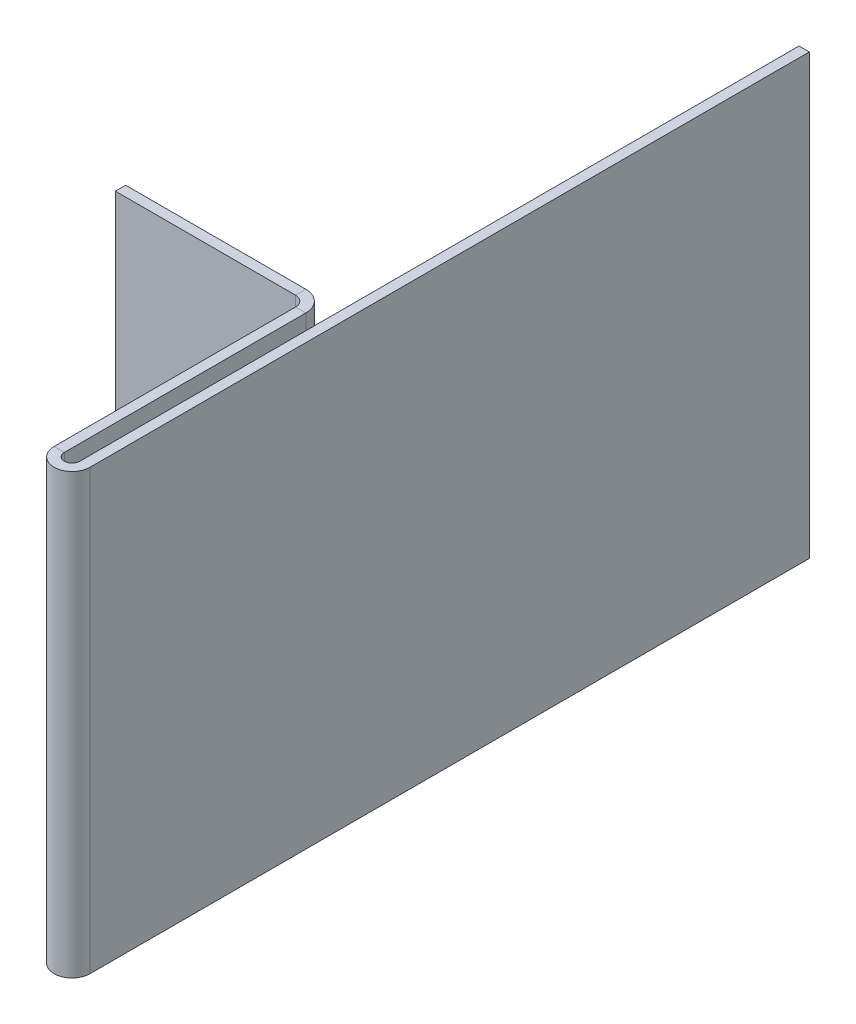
ISO-10303-21;
HEADER;
FILE_DESCRIPTION(('STEP AP214'),'2;1');
FILE_NAME('part.step','',(''),(''),'','','');
FILE_SCHEMA(('AUTOMOTIVE_DESIGN { 1 0 10303 214 1 1 1 1 }'));
ENDSEC;
DATA;
#1=APPLICATION_CONTEXT('core data for automotive mechanical design processes');
#2=APPLICATION_PROTOCOL_DEFINITION('international standard','automotive_design',2000,#1);
#3=PRODUCT_CONTEXT('',#1,'mechanical');
#4=PRODUCT('Part','Part','',(#3));
#5=PRODUCT_RELATED_PRODUCT_CATEGORY('part','',(#4));
#6=PRODUCT_DEFINITION_FORMATION('','',#4);
#7=PRODUCT_DEFINITION_CONTEXT('part definition',#1,'design');
#8=PRODUCT_DEFINITION('design','',#6,#7);
#9=PRODUCT_DEFINITION_SHAPE('','',#8);
#10=(LENGTH_UNIT() NAMED_UNIT(*) SI_UNIT(.MILLI.,.METRE.));
#11=(NAMED_UNIT(*) PLANE_ANGLE_UNIT() SI_UNIT($,.RADIAN.));
#12=(NAMED_UNIT(*) SI_UNIT($,.STERADIAN.) SOLID_ANGLE_UNIT());
#13=UNCERTAINTY_MEASURE_WITH_UNIT(LENGTH_MEASURE(1.E-05),#10,'distance_accuracy_value','');
#14=(GEOMETRIC_REPRESENTATION_CONTEXT(3) GLOBAL_UNCERTAINTY_ASSIGNED_CONTEXT((#13)) GLOBAL_UNIT_ASSIGNED_CONTEXT((#10,
#11,#12)) REPRESENTATION_CONTEXT('',''));
#15=CARTESIAN_POINT('',(0.,0.,0.));
#16=DIRECTION('',(0.,0.,1.));
#17=DIRECTION('',(1.,0.,0.));
#18=AXIS2_PLACEMENT_3D('',#15,#16,#17);
#19=CARTESIAN_POINT('',(-18.537542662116,42.688566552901,2.));
#20=DIRECTION('',(0.,-1.,0.));
#21=DIRECTION('',(0.,0.,-1.));
#22=AXIS2_PLACEMENT_3D('',#19,#20,#21);
#23=PLANE('',#22);
#24=DIRECTION('',(0.,0.,-1.));
#25=VECTOR('',#24,1.);
#26=CARTESIAN_POINT('',(16.5375426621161,42.688566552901,2.));
#27=LINE('',#26,#25);
#28=CARTESIAN_POINT('',(16.5375426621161,42.688566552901,2.));
#29=VERTEX_POINT('',#28);
#30=CARTESIAN_POINT('',(16.5375426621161,42.688566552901,0.));
#31=VERTEX_POINT('',#30);
#32=EDGE_CURVE('E207',#29,#31,#27,.T.);
#33=ORIENTED_EDGE('',*,*,#32,.T.);
#34=DIRECTION('',(-1.,0.,0.));
#35=VECTOR('',#34,1.);
#36=CARTESIAN_POINT('',(-18.537542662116,42.688566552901,0.));
#37=LINE('',#36,#35);
#38=CARTESIAN_POINT('',(-18.537542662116,42.688566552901,0.));
#39=VERTEX_POINT('',#38);
#40=EDGE_CURVE('E217',#31,#39,#37,.T.);
#41=ORIENTED_EDGE('',*,*,#40,.T.);
#42=DIRECTION('',(0.,0.,-1.));
#43=VECTOR('',#42,1.);
#44=CARTESIAN_POINT('',(-18.537542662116,42.688566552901,2.));
#45=LINE('',#44,#43);
#46=CARTESIAN_POINT('',(-18.537542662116,42.688566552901,2.));
#47=VERTEX_POINT('',#46);
#48=EDGE_CURVE('E11',#47,#39,#45,.T.);
#49=ORIENTED_EDGE('',*,*,#48,.F.);
#50=DIRECTION('',(-1.,0.,0.));
#51=VECTOR('',#50,1.);
#52=CARTESIAN_POINT('',(-18.537542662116,42.688566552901,2.));
#53=LINE('',#52,#51);
#54=EDGE_CURVE('E219',#29,#47,#53,.T.);
#55=ORIENTED_EDGE('',*,*,#54,.F.);
#56=EDGE_LOOP('',(#33,#41,#49,#55));
#57=FACE_BOUND('',#56,.T.);
#58=ADVANCED_FACE('F35',(#57),#23,.F.);
#59=CARTESIAN_POINT('',(-18.537542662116,-42.688566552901,2.));
#60=DIRECTION('',(0.,1.,0.));
#61=DIRECTION('',(0.,0.,1.));
#62=AXIS2_PLACEMENT_3D('',#59,#60,#61);
#63=PLANE('',#62);
#64=DIRECTION('',(0.,0.,-1.));
#65=VECTOR('',#64,1.);
#66=CARTESIAN_POINT('',(16.5375426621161,-42.688566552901,2.));
#67=LINE('',#66,#65);
#68=CARTESIAN_POINT('',(16.5375426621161,-42.688566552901,2.));
#69=VERTEX_POINT('',#68);
#70=CARTESIAN_POINT('',(16.5375426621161,-42.688566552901,0.));
#71=VERTEX_POINT('',#70);
#72=EDGE_CURVE('E49',#69,#71,#67,.T.);
#73=ORIENTED_EDGE('',*,*,#72,.F.);
#74=DIRECTION('',(1.,0.,0.));
#75=VECTOR('',#74,1.);
#76=CARTESIAN_POINT('',(-18.537542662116,-42.688566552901,2.));
#77=LINE('',#76,#75);
#78=CARTESIAN_POINT('',(-18.537542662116,-42.688566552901,2.));
#79=VERTEX_POINT('',#78);
#80=EDGE_CURVE('E224',#79,#69,#77,.T.);
#81=ORIENTED_EDGE('',*,*,#80,.F.);
#82=DIRECTION('',(0.,0.,-1.));
#83=VECTOR('',#82,1.);
#84=CARTESIAN_POINT('',(-18.537542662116,-42.688566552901,2.));
#85=LINE('',#84,#83);
#86=CARTESIAN_POINT('',(-18.537542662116,-42.688566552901,0.));
#87=VERTEX_POINT('',#86);
#88=EDGE_CURVE('E42',#79,#87,#85,.T.);
#89=ORIENTED_EDGE('',*,*,#88,.T.);
#90=DIRECTION('',(1.,0.,0.));
#91=VECTOR('',#90,1.);
#92=CARTESIAN_POINT('',(-18.537542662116,-42.688566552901,0.));
#93=LINE('',#92,#91);
#94=EDGE_CURVE('E222',#87,#71,#93,.T.);
#95=ORIENTED_EDGE('',*,*,#94,.T.);
#96=EDGE_LOOP('',(#73,#81,#89,#95));
#97=FACE_BOUND('',#96,.T.);
#98=ADVANCED_FACE('F232',(#97),#63,.F.);
#99=CARTESIAN_POINT('',(18.537542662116,-42.688566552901,2.));
#100=DIRECTION('',(0.,0.,1.));
#101=DIRECTION('',(1.,0.,0.));
#102=AXIS2_PLACEMENT_3D('',#99,#100,#101);
#103=PLANE('',#102);
#104=ORIENTED_EDGE('',*,*,#80,.T.);
#105=DIRECTION('',(0.,1.,0.));
#106=VECTOR('',#105,1.);
#107=CARTESIAN_POINT('',(16.5375426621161,42.688566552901,2.));
#108=LINE('',#107,#106);
#109=EDGE_CURVE('E56',#29,#69,#108,.F.);
#110=ORIENTED_EDGE('',*,*,#109,.F.);
#111=ORIENTED_EDGE('',*,*,#54,.T.);
#112=DIRECTION('',(0.,-1.,0.));
#113=VECTOR('',#112,1.);
#114=CARTESIAN_POINT('',(-18.537542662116,42.688566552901,2.));
#115=LINE('',#114,#113);
#116=EDGE_CURVE('E221',#47,#79,#115,.T.);
#117=ORIENTED_EDGE('',*,*,#116,.T.);
#118=EDGE_LOOP('',(#104,#110,#111,#117));
#119=FACE_BOUND('',#118,.T.);
#120=ADVANCED_FACE('F297',(#119),#103,.T.);
#121=CARTESIAN_POINT('',(18.537542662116,-42.688566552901,0.));
#122=DIRECTION('',(0.,0.,1.));
#123=DIRECTION('',(1.,0.,0.));
#124=AXIS2_PLACEMENT_3D('',#121,#122,#123);
#125=PLANE('',#124);
#126=DIRECTION('',(0.,1.,0.));
#127=VECTOR('',#126,1.);
#128=CARTESIAN_POINT('',(16.5375426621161,42.688566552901,0.));
#129=LINE('',#128,#127);
#130=EDGE_CURVE('E201',#31,#71,#129,.F.);
#131=ORIENTED_EDGE('',*,*,#130,.T.);
#132=ORIENTED_EDGE('',*,*,#94,.F.);
#133=DIRECTION('',(0.,-1.,0.));
#134=VECTOR('',#133,1.);
#135=CARTESIAN_POINT('',(-18.537542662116,42.688566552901,0.));
#136=LINE('',#135,#134);
#137=EDGE_CURVE('E227',#39,#87,#136,.T.);
#138=ORIENTED_EDGE('',*,*,#137,.F.);
#139=ORIENTED_EDGE('',*,*,#40,.F.);
#140=EDGE_LOOP('',(#131,#132,#138,#139));
#141=FACE_BOUND('',#140,.T.);
#142=ADVANCED_FACE('F237',(#141),#125,.F.);
#143=CARTESIAN_POINT('',(-18.537542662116,42.688566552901,2.));
#144=DIRECTION('',(1.,0.,0.));
#145=DIRECTION('',(0.,0.,-1.));
#146=AXIS2_PLACEMENT_3D('',#143,#144,#145);
#147=PLANE('',#146);
#148=ORIENTED_EDGE('',*,*,#137,.T.);
#149=ORIENTED_EDGE('',*,*,#88,.F.);
#150=ORIENTED_EDGE('',*,*,#116,.F.);
#151=ORIENTED_EDGE('',*,*,#48,.T.);
#152=EDGE_LOOP('',(#148,#149,#150,#151));
#153=FACE_BOUND('',#152,.T.);
#154=ADVANCED_FACE('F300',(#153),#147,.F.);
#155=CARTESIAN_POINT('',(16.5375426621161,-42.688566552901,4.));
#156=DIRECTION('',(0.,-1.,0.));
#157=DIRECTION('',(0.,0.,-1.));
#158=AXIS2_PLACEMENT_3D('',#155,#156,#157);
#159=PLANE('',#158);
#160=DIRECTION('',(1.,0.,0.));
#161=VECTOR('',#160,1.);
#162=CARTESIAN_POINT('',(18.5375426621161,-42.688566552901,4.));
#163=LINE('',#162,#161);
#164=CARTESIAN_POINT('',(18.5375426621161,-42.688566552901,4.));
#165=VERTEX_POINT('',#164);
#166=CARTESIAN_POINT('',(20.5375426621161,-42.688566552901,3.99999999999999));
#167=VERTEX_POINT('',#166);
#168=EDGE_CURVE('E161',#165,#167,#163,.T.);
#169=ORIENTED_EDGE('',*,*,#168,.F.);
#170=CARTESIAN_POINT('',(16.5375426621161,-42.688566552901,4.));
#171=DIRECTION('',(0.,1.,0.));
#172=DIRECTION('',(0.,0.,1.));
#173=AXIS2_PLACEMENT_3D('',#170,#171,#172);
#174=CIRCLE('',#173,2.);
#175=EDGE_CURVE('E210',#69,#165,#174,.F.);
#176=ORIENTED_EDGE('',*,*,#175,.F.);
#177=ORIENTED_EDGE('',*,*,#72,.T.);
#178=CARTESIAN_POINT('',(16.5375426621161,-42.688566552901,4.));
#179=DIRECTION('',(0.,1.,0.));
#180=DIRECTION('',(0.,0.,1.));
#181=AXIS2_PLACEMENT_3D('',#178,#179,#180);
#182=CIRCLE('',#181,4.);
#183=EDGE_CURVE('E203',#71,#167,#182,.F.);
#184=ORIENTED_EDGE('',*,*,#183,.T.);
#185=EDGE_LOOP('',(#169,#176,#177,#184));
#186=FACE_BOUND('',#185,.T.);
#187=ADVANCED_FACE('F302',(#186),#159,.T.);
#188=CARTESIAN_POINT('',(16.5375426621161,42.688566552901,4.));
#189=DIRECTION('',(0.,-1.,0.));
#190=DIRECTION('',(0.,0.,-1.));
#191=AXIS2_PLACEMENT_3D('',#188,#189,#190);
#192=PLANE('',#191);
#193=CARTESIAN_POINT('',(16.5375426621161,42.688566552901,4.));
#194=DIRECTION('',(0.,1.,0.));
#195=DIRECTION('',(0.,0.,1.));
#196=AXIS2_PLACEMENT_3D('',#193,#194,#195);
#197=CIRCLE('',#196,2.);
#198=CARTESIAN_POINT('',(18.5375426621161,42.688566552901,4.));
#199=VERTEX_POINT('',#198);
#200=EDGE_CURVE('E200',#199,#29,#197,.T.);
#201=ORIENTED_EDGE('',*,*,#200,.F.);
#202=DIRECTION('',(1.,0.,0.));
#203=VECTOR('',#202,1.);
#204=CARTESIAN_POINT('',(18.5375426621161,42.688566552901,4.));
#205=LINE('',#204,#203);
#206=CARTESIAN_POINT('',(20.5375426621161,42.688566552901,3.99999999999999));
#207=VERTEX_POINT('',#206);
#208=EDGE_CURVE('E172',#199,#207,#205,.T.);
#209=ORIENTED_EDGE('',*,*,#208,.T.);
#210=CARTESIAN_POINT('',(16.5375426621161,42.688566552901,4.));
#211=DIRECTION('',(0.,1.,0.));
#212=DIRECTION('',(0.,0.,1.));
#213=AXIS2_PLACEMENT_3D('',#210,#211,#212);
#214=CIRCLE('',#213,4.);
#215=EDGE_CURVE('E204',#207,#31,#214,.T.);
#216=ORIENTED_EDGE('',*,*,#215,.T.);
#217=ORIENTED_EDGE('',*,*,#32,.F.);
#218=EDGE_LOOP('',(#201,#209,#216,#217));
#219=FACE_BOUND('',#218,.T.);
#220=ADVANCED_FACE('F246',(#219),#192,.F.);
#221=CARTESIAN_POINT('',(16.5375426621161,42.688566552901,4.));
#222=DIRECTION('',(0.,1.,0.));
#223=DIRECTION('',(1.,0.,0.));
#224=AXIS2_PLACEMENT_3D('',#221,#222,#223);
#225=CYLINDRICAL_SURFACE('',#224,4.);
#226=ORIENTED_EDGE('',*,*,#130,.F.);
#227=ORIENTED_EDGE('',*,*,#215,.F.);
#228=DIRECTION('',(0.,-1.,0.));
#229=VECTOR('',#228,1.);
#230=CARTESIAN_POINT('',(20.5375426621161,-42.688566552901,3.99999999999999));
#231=LINE('',#230,#229);
#232=EDGE_CURVE('E175',#207,#167,#231,.T.);
#233=ORIENTED_EDGE('',*,*,#232,.T.);
#234=ORIENTED_EDGE('',*,*,#183,.F.);
#235=EDGE_LOOP('',(#226,#227,#233,#234));
#236=FACE_BOUND('',#235,.T.);
#237=ADVANCED_FACE('F242',(#236),#225,.T.);
#238=CARTESIAN_POINT('',(16.5375426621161,42.688566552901,4.));
#239=DIRECTION('',(0.,1.,0.));
#240=DIRECTION('',(1.,0.,0.));
#241=AXIS2_PLACEMENT_3D('',#238,#239,#240);
#242=CYLINDRICAL_SURFACE('',#241,2.);
#243=ORIENTED_EDGE('',*,*,#109,.T.);
#244=ORIENTED_EDGE('',*,*,#175,.T.);
#245=DIRECTION('',(0.,1.,0.));
#246=VECTOR('',#245,1.);
#247=CARTESIAN_POINT('',(18.5375426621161,-42.688566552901,4.));
#248=LINE('',#247,#246);
#249=EDGE_CURVE('E170',#165,#199,#248,.T.);
#250=ORIENTED_EDGE('',*,*,#249,.T.);
#251=ORIENTED_EDGE('',*,*,#200,.T.);
#252=EDGE_LOOP('',(#243,#244,#250,#251));
#253=FACE_BOUND('',#252,.T.);
#254=ADVANCED_FACE('F314',(#253),#242,.F.);
#255=CARTESIAN_POINT('',(20.537542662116,-42.688566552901,1.99999999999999));
#256=DIRECTION('',(0.,1.,0.));
#257=DIRECTION('',(0.,0.,1.));
#258=AXIS2_PLACEMENT_3D('',#255,#256,#257);
#259=PLANE('',#258);
#260=ORIENTED_EDGE('',*,*,#168,.T.);
#261=DIRECTION('',(0.,0.,-1.));
#262=VECTOR('',#261,1.);
#263=CARTESIAN_POINT('',(20.537542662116,-42.688566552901,1.99999999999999));
#264=LINE('',#263,#262);
#265=CARTESIAN_POINT('',(20.5375426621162,-42.688566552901,51.));
#266=VERTEX_POINT('',#265);
#267=EDGE_CURVE('E180',#266,#167,#264,.T.);
#268=ORIENTED_EDGE('',*,*,#267,.F.);
#269=DIRECTION('',(-1.,0.,0.));
#270=VECTOR('',#269,1.);
#271=CARTESIAN_POINT('',(20.5375426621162,-42.688566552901,51.));
#272=LINE('',#271,#270);
#273=CARTESIAN_POINT('',(18.5375426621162,-42.688566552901,51.));
#274=VERTEX_POINT('',#273);
#275=EDGE_CURVE('E188',#266,#274,#272,.T.);
#276=ORIENTED_EDGE('',*,*,#275,.T.);
#277=DIRECTION('',(0.,0.,-1.));
#278=VECTOR('',#277,1.);
#279=CARTESIAN_POINT('',(18.537542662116,-42.688566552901,2.));
#280=LINE('',#279,#278);
#281=EDGE_CURVE('E179',#274,#165,#280,.T.);
#282=ORIENTED_EDGE('',*,*,#281,.T.);
#283=EDGE_LOOP('',(#260,#268,#276,#282));
#284=FACE_BOUND('',#283,.T.);
#285=ADVANCED_FACE('F275',(#284),#259,.F.);
#286=CARTESIAN_POINT('',(20.5375426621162,42.688566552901,51.));
#287=DIRECTION('',(0.,-1.,0.));
#288=DIRECTION('',(0.,0.,-1.));
#289=AXIS2_PLACEMENT_3D('',#286,#287,#288);
#290=PLANE('',#289);
#291=ORIENTED_EDGE('',*,*,#208,.F.);
#292=DIRECTION('',(0.,0.,1.));
#293=VECTOR('',#292,1.);
#294=CARTESIAN_POINT('',(18.5375426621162,42.688566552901,51.));
#295=LINE('',#294,#293);
#296=CARTESIAN_POINT('',(18.5375426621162,42.688566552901,51.));
#297=VERTEX_POINT('',#296);
#298=EDGE_CURVE('E191',#199,#297,#295,.T.);
#299=ORIENTED_EDGE('',*,*,#298,.T.);
#300=DIRECTION('',(-1.,0.,0.));
#301=VECTOR('',#300,1.);
#302=CARTESIAN_POINT('',(20.5375426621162,42.688566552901,51.));
#303=LINE('',#302,#301);
#304=CARTESIAN_POINT('',(20.5375426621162,42.688566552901,51.));
#305=VERTEX_POINT('',#304);
#306=EDGE_CURVE('E197',#305,#297,#303,.T.);
#307=ORIENTED_EDGE('',*,*,#306,.F.);
#308=DIRECTION('',(0.,0.,1.));
#309=VECTOR('',#308,1.);
#310=CARTESIAN_POINT('',(20.5375426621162,42.688566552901,51.));
#311=LINE('',#310,#309);
#312=EDGE_CURVE('E183',#207,#305,#311,.T.);
#313=ORIENTED_EDGE('',*,*,#312,.F.);
#314=EDGE_LOOP('',(#291,#299,#307,#313));
#315=FACE_BOUND('',#314,.T.);
#316=ADVANCED_FACE('F256',(#315),#290,.F.);
#317=CARTESIAN_POINT('',(20.5375426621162,-42.688566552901,51.));
#318=DIRECTION('',(-1.,0.,0.));
#319=DIRECTION('',(0.,0.,1.));
#320=AXIS2_PLACEMENT_3D('',#317,#318,#319);
#321=PLANE('',#320);
#322=ORIENTED_EDGE('',*,*,#232,.F.);
#323=ORIENTED_EDGE('',*,*,#312,.T.);
#324=DIRECTION('',(0.,-1.,0.));
#325=VECTOR('',#324,1.);
#326=CARTESIAN_POINT('',(20.5375426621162,-42.688566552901,51.));
#327=LINE('',#326,#325);
#328=EDGE_CURVE('E186',#305,#266,#327,.T.);
#329=ORIENTED_EDGE('',*,*,#328,.T.);
#330=ORIENTED_EDGE('',*,*,#267,.T.);
#331=EDGE_LOOP('',(#322,#323,#329,#330));
#332=FACE_BOUND('',#331,.T.);
#333=ADVANCED_FACE('F253',(#332),#321,.F.);
#334=CARTESIAN_POINT('',(18.5375426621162,-42.688566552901,51.));
#335=DIRECTION('',(-1.,0.,0.));
#336=DIRECTION('',(0.,0.,1.));
#337=AXIS2_PLACEMENT_3D('',#334,#335,#336);
#338=PLANE('',#337);
#339=ORIENTED_EDGE('',*,*,#298,.F.);
#340=ORIENTED_EDGE('',*,*,#249,.F.);
#341=ORIENTED_EDGE('',*,*,#281,.F.);
#342=DIRECTION('',(0.,-1.,0.));
#343=VECTOR('',#342,1.);
#344=CARTESIAN_POINT('',(18.5375426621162,-42.688566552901,51.));
#345=LINE('',#344,#343);
#346=EDGE_CURVE('E184',#297,#274,#345,.T.);
#347=ORIENTED_EDGE('',*,*,#346,.F.);
#348=EDGE_LOOP('',(#339,#340,#341,#347));
#349=FACE_BOUND('',#348,.T.);
#350=ADVANCED_FACE('F278',(#349),#338,.T.);
#351=CARTESIAN_POINT('',(22.0375426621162,42.688566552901,51.));
#352=DIRECTION('',(0.,1.,0.));
#353=DIRECTION('',(0.,0.,1.));
#354=AXIS2_PLACEMENT_3D('',#351,#352,#353);
#355=PLANE('',#354);
#356=CARTESIAN_POINT('',(22.0375426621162,42.688566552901,51.));
#357=DIRECTION('',(0.,-1.,0.));
#358=DIRECTION('',(0.,0.,-1.));
#359=AXIS2_PLACEMENT_3D('',#356,#357,#358);
#360=CIRCLE('',#359,3.49999999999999);
#361=CARTESIAN_POINT('',(25.5375426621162,42.688566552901,51.));
#362=VERTEX_POINT('',#361);
#363=EDGE_CURVE('E158',#297,#362,#360,.F.);
#364=ORIENTED_EDGE('',*,*,#363,.T.);
#365=DIRECTION('',(0.,0.,1.));
#366=VECTOR('',#365,1.);
#367=CARTESIAN_POINT('',(25.5375426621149,42.688566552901,-89.));
#368=LINE('',#367,#366);
#369=CARTESIAN_POINT('',(25.5375426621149,42.688566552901,-89.));
#370=VERTEX_POINT('',#369);
#371=EDGE_CURVE('E267',#370,#362,#368,.T.);
#372=ORIENTED_EDGE('',*,*,#371,.F.);
#373=DIRECTION('',(1.,0.,0.));
#374=VECTOR('',#373,1.);
#375=CARTESIAN_POINT('',(23.5375426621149,42.688566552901,-89.));
#376=LINE('',#375,#374);
#377=CARTESIAN_POINT('',(23.5375426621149,42.688566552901,-89.));
#378=VERTEX_POINT('',#377);
#379=EDGE_CURVE('E141',#378,#370,#376,.T.);
#380=ORIENTED_EDGE('',*,*,#379,.F.);
#381=DIRECTION('',(0.,0.,1.));
#382=VECTOR('',#381,1.);
#383=CARTESIAN_POINT('',(23.5375426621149,42.688566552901,-89.));
#384=LINE('',#383,#382);
#385=CARTESIAN_POINT('',(23.5375426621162,42.688566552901,51.));
#386=VERTEX_POINT('',#385);
#387=EDGE_CURVE('E154',#378,#386,#384,.T.);
#388=ORIENTED_EDGE('',*,*,#387,.T.);
#389=CARTESIAN_POINT('',(22.0375426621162,42.688566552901,51.));
#390=DIRECTION('',(0.,-1.,0.));
#391=DIRECTION('',(0.,0.,-1.));
#392=AXIS2_PLACEMENT_3D('',#389,#390,#391);
#393=CIRCLE('',#392,1.49999999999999);
#394=EDGE_CURVE('E164',#305,#386,#393,.F.);
#395=ORIENTED_EDGE('',*,*,#394,.F.);
#396=ORIENTED_EDGE('',*,*,#306,.T.);
#397=EDGE_LOOP('',(#364,#372,#380,#388,#395,#396));
#398=FACE_BOUND('',#397,.T.);
#399=ADVANCED_FACE('F264',(#398),#355,.T.);
#400=CARTESIAN_POINT('',(22.0375426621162,-42.688566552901,51.));
#401=DIRECTION('',(0.,1.,0.));
#402=DIRECTION('',(0.,0.,1.));
#403=AXIS2_PLACEMENT_3D('',#400,#401,#402);
#404=PLANE('',#403);
#405=CARTESIAN_POINT('',(22.0375426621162,-42.688566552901,51.));
#406=DIRECTION('',(0.,-1.,0.));
#407=DIRECTION('',(0.,0.,-1.));
#408=AXIS2_PLACEMENT_3D('',#405,#406,#407);
#409=CIRCLE('',#408,1.49999999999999);
#410=CARTESIAN_POINT('',(23.5375426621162,-42.688566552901,51.));
#411=VERTEX_POINT('',#410);
#412=EDGE_CURVE('E152',#411,#266,#409,.T.);
#413=ORIENTED_EDGE('',*,*,#412,.F.);
#414=DIRECTION('',(0.,0.,1.));
#415=VECTOR('',#414,1.);
#416=CARTESIAN_POINT('',(23.5375426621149,-42.688566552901,-89.));
#417=LINE('',#416,#415);
#418=CARTESIAN_POINT('',(23.5375426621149,-42.688566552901,-89.));
#419=VERTEX_POINT('',#418);
#420=EDGE_CURVE('E132',#419,#411,#417,.T.);
#421=ORIENTED_EDGE('',*,*,#420,.F.);
#422=DIRECTION('',(-1.,0.,0.));
#423=VECTOR('',#422,1.);
#424=CARTESIAN_POINT('',(25.5375426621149,-42.688566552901,-89.));
#425=LINE('',#424,#423);
#426=CARTESIAN_POINT('',(25.5375426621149,-42.688566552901,-89.));
#427=VERTEX_POINT('',#426);
#428=EDGE_CURVE('E124',#427,#419,#425,.T.);
#429=ORIENTED_EDGE('',*,*,#428,.F.);
#430=DIRECTION('',(0.,0.,1.));
#431=VECTOR('',#430,1.);
#432=CARTESIAN_POINT('',(25.5375426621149,-42.688566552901,-89.));
#433=LINE('',#432,#431);
#434=CARTESIAN_POINT('',(25.5375426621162,-42.688566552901,51.));
#435=VERTEX_POINT('',#434);
#436=EDGE_CURVE('E130',#427,#435,#433,.T.);
#437=ORIENTED_EDGE('',*,*,#436,.T.);
#438=CARTESIAN_POINT('',(22.0375426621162,-42.688566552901,51.));
#439=DIRECTION('',(0.,-1.,0.));
#440=DIRECTION('',(0.,0.,-1.));
#441=AXIS2_PLACEMENT_3D('',#438,#439,#440);
#442=CIRCLE('',#441,3.49999999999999);
#443=EDGE_CURVE('E162',#435,#274,#442,.T.);
#444=ORIENTED_EDGE('',*,*,#443,.T.);
#445=ORIENTED_EDGE('',*,*,#275,.F.);
#446=EDGE_LOOP('',(#413,#421,#429,#437,#444,#445));
#447=FACE_BOUND('',#446,.T.);
#448=ADVANCED_FACE('F127',(#447),#404,.F.);
#449=CARTESIAN_POINT('',(22.0375426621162,-42.688566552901,51.));
#450=DIRECTION('',(0.,-1.,0.));
#451=DIRECTION('',(1.,0.,0.));
#452=AXIS2_PLACEMENT_3D('',#449,#450,#451);
#453=CYLINDRICAL_SURFACE('',#452,3.49999999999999);
#454=ORIENTED_EDGE('',*,*,#346,.T.);
#455=ORIENTED_EDGE('',*,*,#443,.F.);
#456=DIRECTION('',(0.,-1.,0.));
#457=VECTOR('',#456,1.);
#458=CARTESIAN_POINT('',(25.5375426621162,-42.688566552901,51.));
#459=LINE('',#458,#457);
#460=EDGE_CURVE('E147',#362,#435,#459,.T.);
#461=ORIENTED_EDGE('',*,*,#460,.F.);
#462=ORIENTED_EDGE('',*,*,#363,.F.);
#463=EDGE_LOOP('',(#454,#455,#461,#462));
#464=FACE_BOUND('',#463,.T.);
#465=ADVANCED_FACE('F280',(#464),#453,.T.);
#466=CARTESIAN_POINT('',(22.0375426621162,-42.688566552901,51.));
#467=DIRECTION('',(0.,-1.,0.));
#468=DIRECTION('',(1.,0.,0.));
#469=AXIS2_PLACEMENT_3D('',#466,#467,#468);
#470=CYLINDRICAL_SURFACE('',#469,1.49999999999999);
#471=ORIENTED_EDGE('',*,*,#328,.F.);
#472=ORIENTED_EDGE('',*,*,#394,.T.);
#473=DIRECTION('',(0.,-1.,0.));
#474=VECTOR('',#473,1.);
#475=CARTESIAN_POINT('',(23.5375426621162,-42.688566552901,51.));
#476=LINE('',#475,#474);
#477=EDGE_CURVE('E149',#386,#411,#476,.T.);
#478=ORIENTED_EDGE('',*,*,#477,.T.);
#479=ORIENTED_EDGE('',*,*,#412,.T.);
#480=EDGE_LOOP('',(#471,#472,#478,#479));
#481=FACE_BOUND('',#480,.T.);
#482=ADVANCED_FACE('F262',(#481),#470,.F.);
#483=CARTESIAN_POINT('',(25.5375426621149,42.688566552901,-89.));
#484=DIRECTION('',(-1.,0.,0.));
#485=DIRECTION('',(0.,0.,1.));
#486=AXIS2_PLACEMENT_3D('',#483,#484,#485);
#487=PLANE('',#486);
#488=ORIENTED_EDGE('',*,*,#460,.T.);
#489=ORIENTED_EDGE('',*,*,#436,.F.);
#490=DIRECTION('',(0.,-1.,0.));
#491=VECTOR('',#490,1.);
#492=CARTESIAN_POINT('',(25.5375426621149,42.688566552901,-89.));
#493=LINE('',#492,#491);
#494=EDGE_CURVE('E136',#370,#427,#493,.T.);
#495=ORIENTED_EDGE('',*,*,#494,.F.);
#496=ORIENTED_EDGE('',*,*,#371,.T.);
#497=EDGE_LOOP('',(#488,#489,#495,#496));
#498=FACE_BOUND('',#497,.T.);
#499=ADVANCED_FACE('F145',(#498),#487,.F.);
#500=CARTESIAN_POINT('',(23.5375426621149,-42.688566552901,-89.));
#501=DIRECTION('',(1.,0.,0.));
#502=DIRECTION('',(0.,0.,-1.));
#503=AXIS2_PLACEMENT_3D('',#500,#501,#502);
#504=PLANE('',#503);
#505=ORIENTED_EDGE('',*,*,#477,.F.);
#506=ORIENTED_EDGE('',*,*,#387,.F.);
#507=DIRECTION('',(0.,1.,0.));
#508=VECTOR('',#507,1.);
#509=CARTESIAN_POINT('',(23.5375426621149,-42.688566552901,-89.));
#510=LINE('',#509,#508);
#511=EDGE_CURVE('E135',#419,#378,#510,.T.);
#512=ORIENTED_EDGE('',*,*,#511,.F.);
#513=ORIENTED_EDGE('',*,*,#420,.T.);
#514=EDGE_LOOP('',(#505,#506,#512,#513));
#515=FACE_BOUND('',#514,.T.);
#516=ADVANCED_FACE('F271',(#515),#504,.F.);
#517=CARTESIAN_POINT('',(25.5375426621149,-42.688566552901,-89.));
#518=DIRECTION('',(0.,0.,-1.));
#519=DIRECTION('',(-1.,0.,0.));
#520=AXIS2_PLACEMENT_3D('',#517,#518,#519);
#521=PLANE('',#520);
#522=ORIENTED_EDGE('',*,*,#494,.T.);
#523=ORIENTED_EDGE('',*,*,#428,.T.);
#524=ORIENTED_EDGE('',*,*,#511,.T.);
#525=ORIENTED_EDGE('',*,*,#379,.T.);
#526=EDGE_LOOP('',(#522,#523,#524,#525));
#527=FACE_BOUND('',#526,.T.);
#528=ADVANCED_FACE('F139',(#527),#521,.T.);
#529=CLOSED_SHELL('',(#58,#98,#120,#142,#154,#187,#220,#237,#254,#285,#316,#333,#350,#399,#448,
#465,#482,#499,#516,#528));
#530=MANIFOLD_SOLID_BREP('B2',#529);
#531=ADVANCED_BREP_SHAPE_REPRESENTATION('',(#18,#530),#14);
#532=SHAPE_DEFINITION_REPRESENTATION(#9,#531);
ENDSEC;
END-ISO-10303-21;
